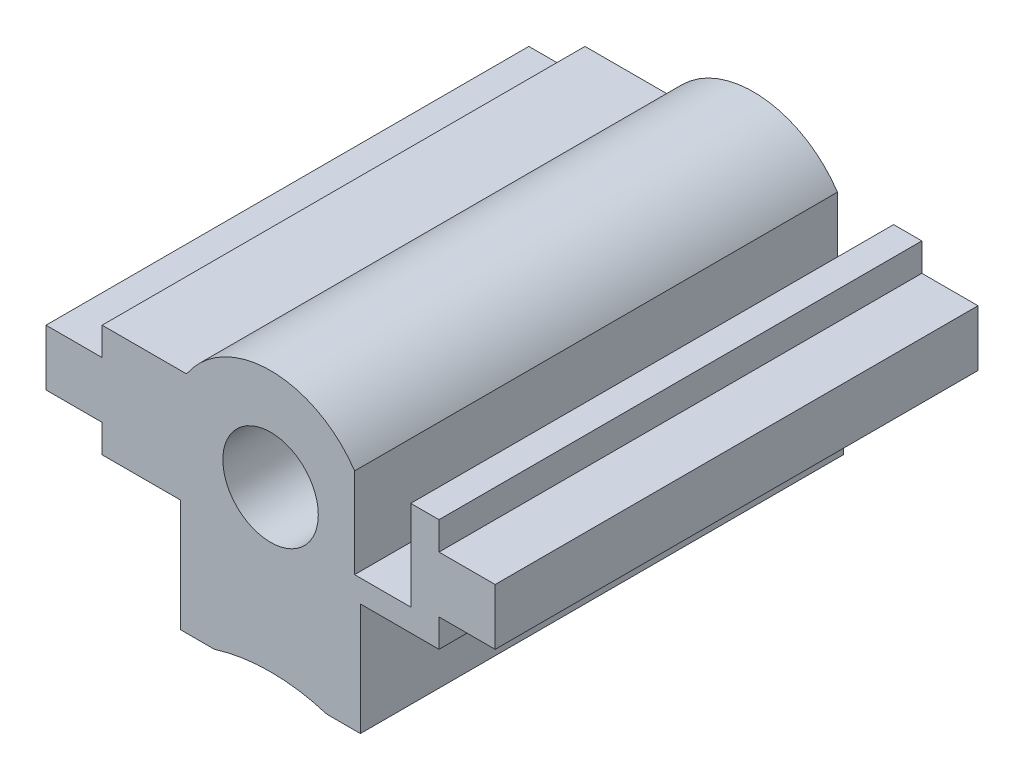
from build123d import *

# Parameters (mm, degrees)
BOSS_EXTRUDE2_DEPTH = 43
BOSS_EXTRUDE3_DEPTH = 3
SKETCH4_W           = 10
SKETCH4_H           = 4
CUT_EXTRUDE1_DEPTH  = 3
BOSS_EXTRUDE4_DEPTH = 43
CUT_EXTRUDE3_REACH  = 51.739
SKETCH7_R           = 4.25
CUT_EXTRUDE4_REACH  = 51.739
SKETCH9_W           = 5
SKETCH9_H           = 8


with BuildPart() as part:
    # Sketch2 → Boss-Extrude2 (new body)
    with BuildSketch(Plane.XY):
        Polygon((15, 2.5), (20, 2.5), (20, -2.5), (15, -2.5), (15, -5), (8, -5), (8, -15), (5, -15), (5, -12), (2, -12), (2, -8), (5, -8), (5, -5), (-5, -5), (-5, -8), (-2, -8), (-2, -12), (-5, -12), (-5, -15), (-8, -15), (-8, -5), (-15, -5), (-15, -2.5), (-20, -2.5), (-20, 2.5), (-15, 2.5), (-15, 5), (15, 5), align=None)
    extrude(amount=BOSS_EXTRUDE2_DEPTH)

    # Sketch3 → Boss-Extrude3 (add)
    with BuildSketch(Plane.XY.offset(43)):
        with BuildLine():
            Line((-8, -5), (8, -5))
            Line((8, -5), (8, -15))
            Line((8, -15), (5, -15))
            ThreePointArc((5, -15), (0, -14.236322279), (-5, -15))
            Line((-5, -15), (-8, -15))
            Line((-8, -15), (-8, -5))
        make_face()
    extrude(amount=-BOSS_EXTRUDE3_DEPTH)

    # Sketch4 → Cut-Extrude1 (cut)
    with BuildSketch(Plane(origin=(0, 0, 0), x_dir=(-1, 0, 0), z_dir=(0, 0, -1))):
        with Locations((0, -10)):
            Rectangle(SKETCH4_W, SKETCH4_H)
    extrude(amount=-CUT_EXTRUDE1_DEPTH, mode=Mode.SUBTRACT)

    # Sketch6 → Boss-Extrude4 (add)
    with BuildSketch(Plane.XY):
        with BuildLine():
            Line((-7.483314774, 5), (7.483314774, 5))
            ThreePointArc((7.483314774, 5), (0, 9), (-7.483314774, 5))
        make_face()
    extrude(amount=BOSS_EXTRUDE4_DEPTH)

    # Sketch7 → Cut-Extrude3 (cut, up to next)
    with BuildSketch(Plane.XY.offset(43), mode=Mode.PRIVATE) as cut_extrude3_sk1:
        Circle(SKETCH7_R)
    cut_extrude3_tool1 = extrude(cut_extrude3_sk1.sketch, amount=-CUT_EXTRUDE3_REACH, mode=Mode.PRIVATE) & part.part
    add(cut_extrude3_tool1.solids().sort_by_distance((0, 0, 43))[0], mode=Mode.SUBTRACT)

    # Sketch9 → Cut-Extrude4 (cut, up to next)
    with BuildSketch(Plane.XY.offset(43), mode=Mode.PRIVATE) as cut_extrude4_sk1:
        with Locations((9.983314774, 1)):
            Rectangle(SKETCH9_W, SKETCH9_H)
    cut_extrude4_tool1 = extrude(cut_extrude4_sk1.sketch, amount=-CUT_EXTRUDE4_REACH, mode=Mode.PRIVATE) & part.part
    add(cut_extrude4_tool1.solids().sort_by_distance((9.983315, 1, 43))[0], mode=Mode.SUBTRACT)


solid = part.part
